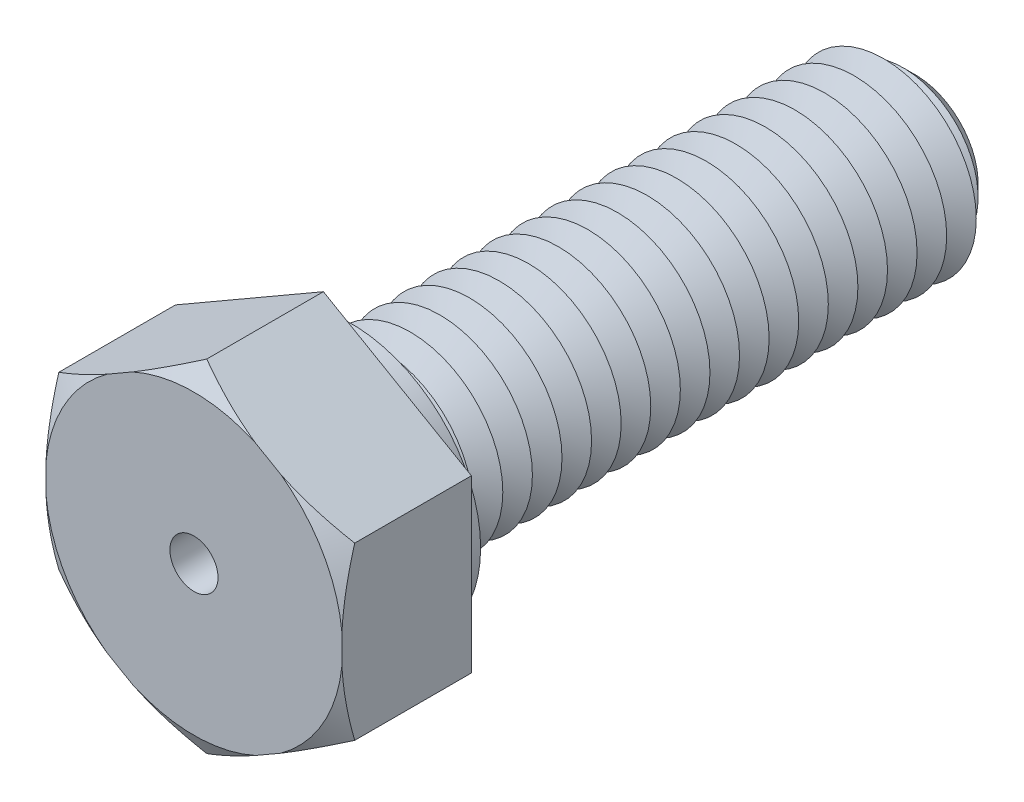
from build123d import *

# Parameters (mm, degrees)
BOSS_EXTRUDE1_DEPTH = 3.5
SKETCH3_R           = 2.5
BOSS_EXTRUDE2_DEPTH = 16
SKETCH4_R           = 3.5
BOSS_EXTRUDE3_DEPTH = 0.75
CHAMFER1_SIZE       = 0.8
LPATTERN1_COUNT     = 19
LPATTERN1_PITCH     = 0.8
SKETCH8_R           = 0.65
CUT_EXTRUDE1_DEPTH  = 19.5


with BuildPart() as part:
    # Sketch2 → Boss-Extrude1 (new body)
    with BuildSketch(Plane.XY):
        Polygon((0, 4.618802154), (-4, 2.309401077), (-4, -2.309401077), (0, -4.618802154), (4, -2.309401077), (4, 2.309401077), align=None)
    extrude(amount=BOSS_EXTRUDE1_DEPTH)

    # Sketch3 → Boss-Extrude2 (add)
    with BuildSketch(Plane(origin=(0, 0, 0), x_dir=(-1, 0, 0), z_dir=(0, 0, -1))):
        Circle(SKETCH3_R)
    extrude(amount=BOSS_EXTRUDE2_DEPTH)

    # Sketch4 → Boss-Extrude3 (add)
    with BuildSketch(Plane(origin=(0, 0, 0), x_dir=(-1, 0, 0), z_dir=(0, 0, -1))):
        with Locations(Location((0, 0, 0), (0, 0, 180))):
            Circle(SKETCH4_R)
    extrude(amount=BOSS_EXTRUDE3_DEPTH)

    # Chamfer1
    chamfer1_edges = [part.edges().sort_by_distance(p)[0] for p in [
        (2.5, 0, -16),
    ]]
    chamfer(chamfer1_edges, length=CHAMFER1_SIZE)

    # Sketch6 → Cut-Revolve1 (revolve, cut)
    with BuildSketch(Plane(origin=(0, 0, 0), x_dir=(0, 0, -1), z_dir=(1, 0, 0)), mode=Mode.PRIVATE) as cut_revolve1_sk:
        Polygon((0.75, 2.5), (1.15, 1.807179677), (1.55, 2.5), align=None)
    cut_revolve1 = revolve(cut_revolve1_sk.sketch.rotate(Axis((0, 0, 3.211670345), (0, 0, -1)), 90), axis=Axis((0, 0, 3.211670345), (0, 0, -1)), mode=Mode.SUBTRACT)

    # LPattern1: Cut-Revolve1 ×19
    with Locations(*[(0, 0, -i * LPATTERN1_PITCH) for i in range(1, LPATTERN1_COUNT)]):
        add(cut_revolve1, mode=Mode.SUBTRACT)

    # Sketch7 → Cut-Revolve2 (revolve, cut)
    with BuildSketch(Plane(origin=(0, 0, 0), x_dir=(0, 0, -1), z_dir=(1, 0, 0)), mode=Mode.PRIVATE) as cut_revolve2_sk:
        Polygon((-3.5, 4.618802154), (-3.5, 4.018802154), (-3.153589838, 4.618802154), align=None)
    revolve(cut_revolve2_sk.sketch.rotate(Axis((0, 0, 3.211670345), (0, 0, -1)), 270), axis=Axis((0, 0, 3.211670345), (0, 0, -1)), mode=Mode.SUBTRACT)

    # Sketch8 → Cut-Extrude1 (cut)
    with BuildSketch(Plane.XY.offset(3.5)):
        Circle(SKETCH8_R)
    extrude(amount=-CUT_EXTRUDE1_DEPTH, mode=Mode.SUBTRACT)


solid = part.part
